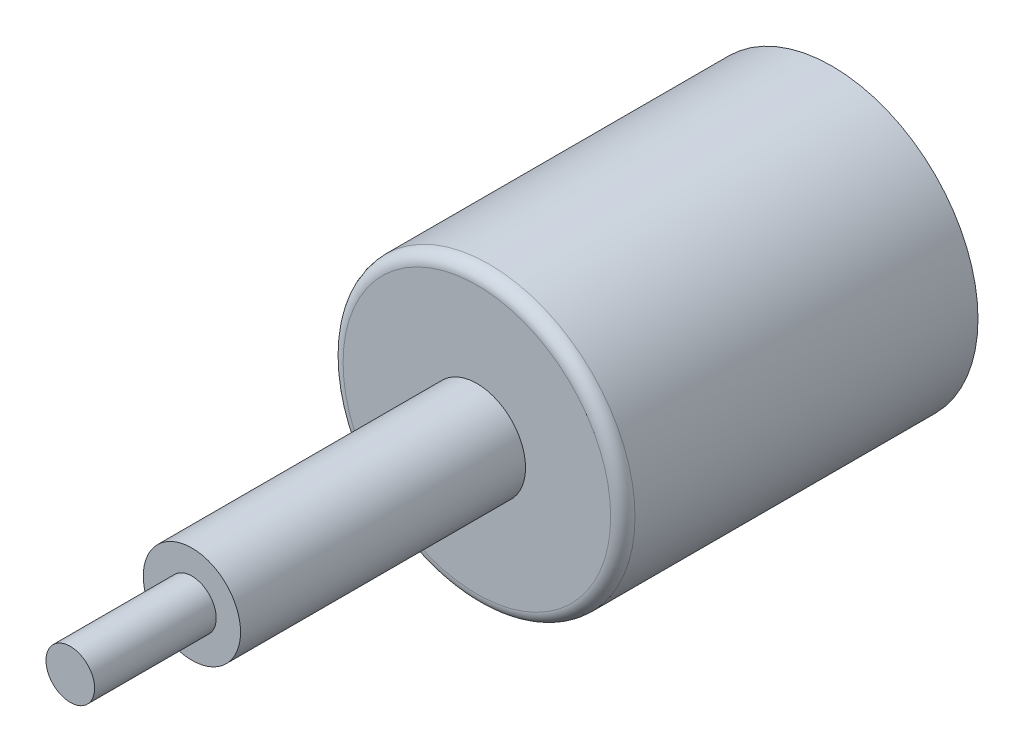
from build123d import *

# Parameters (mm, degrees)
ESQUISSE1_R      = 12
EXTRUSION1_DEPTH = 29.2
CONG_1_R         = 1
ESQUISSE2_R      = 4
EXTRUSION2_DEPTH = 23.43
ESQUISSE3_R      = 2
EXTRUSION3_DEPTH = 10


with BuildPart() as part:
    # Esquisse1 → Extrusion1 (new body)
    with BuildSketch(Plane.XY):
        Circle(ESQUISSE1_R)
    extrude(amount=EXTRUSION1_DEPTH)

    # Cong_1
    cong_1_edges = [part.edges().sort_by_distance(p)[0] for p in [
        (-12, 0, 29.2),
    ]]
    fillet(cong_1_edges, radius=CONG_1_R)

    # Esquisse2 → Extrusion2 (add)
    with BuildSketch(Plane.XY.offset(29.2)):
        Circle(ESQUISSE2_R)
    extrude(amount=EXTRUSION2_DEPTH)

    # Esquisse3 → Extrusion3 (add)
    with BuildSketch(Plane.XY.offset(52.63)):
        Circle(ESQUISSE3_R)
    extrude(amount=EXTRUSION3_DEPTH)


solid = part.part
